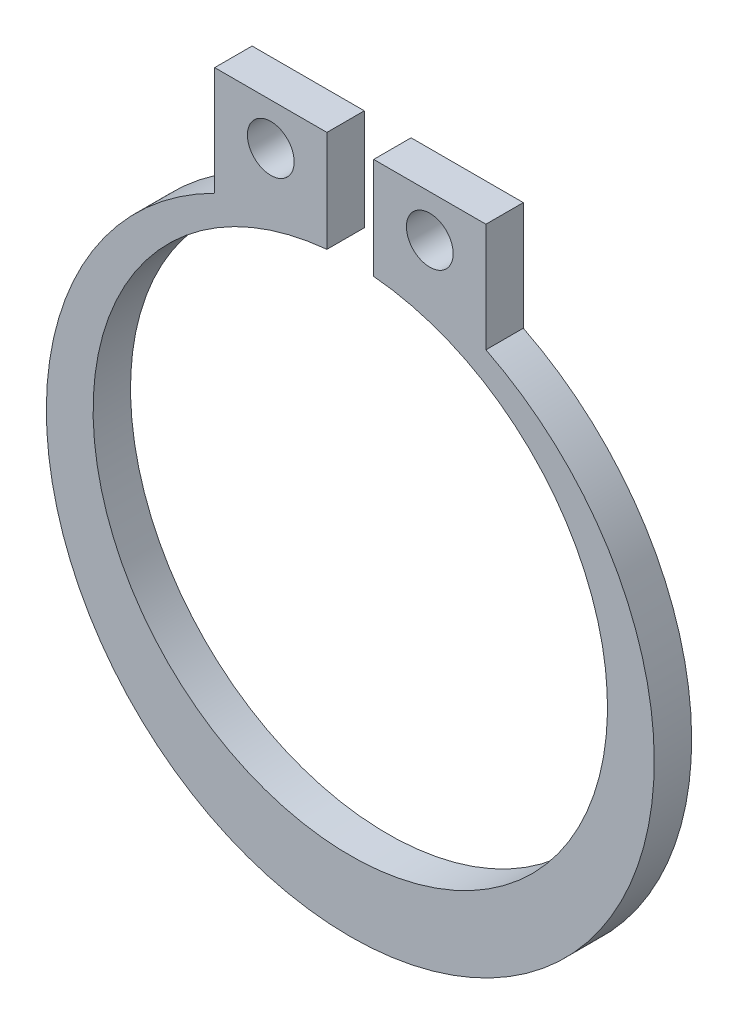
ISO-10303-21;
HEADER;
FILE_DESCRIPTION(('STEP AP214'),'2;1');
FILE_NAME('part.step','',(''),(''),'','','');
FILE_SCHEMA(('AUTOMOTIVE_DESIGN { 1 0 10303 214 1 1 1 1 }'));
ENDSEC;
DATA;
#1=APPLICATION_CONTEXT('core data for automotive mechanical design processes');
#2=APPLICATION_PROTOCOL_DEFINITION('international standard','automotive_design',2000,#1);
#3=PRODUCT_CONTEXT('',#1,'mechanical');
#4=PRODUCT('Part','Part','',(#3));
#5=PRODUCT_RELATED_PRODUCT_CATEGORY('part','',(#4));
#6=PRODUCT_DEFINITION_FORMATION('','',#4);
#7=PRODUCT_DEFINITION_CONTEXT('part definition',#1,'design');
#8=PRODUCT_DEFINITION('design','',#6,#7);
#9=PRODUCT_DEFINITION_SHAPE('','',#8);
#10=(LENGTH_UNIT() NAMED_UNIT(*) SI_UNIT(.MILLI.,.METRE.));
#11=(NAMED_UNIT(*) PLANE_ANGLE_UNIT() SI_UNIT($,.RADIAN.));
#12=(NAMED_UNIT(*) SI_UNIT($,.STERADIAN.) SOLID_ANGLE_UNIT());
#13=UNCERTAINTY_MEASURE_WITH_UNIT(LENGTH_MEASURE(1.E-05),#10,'distance_accuracy_value','');
#14=(GEOMETRIC_REPRESENTATION_CONTEXT(3) GLOBAL_UNCERTAINTY_ASSIGNED_CONTEXT((#13)) GLOBAL_UNIT_ASSIGNED_CONTEXT((#10,
#11,#12)) REPRESENTATION_CONTEXT('',''));
#15=CARTESIAN_POINT('',(0.,0.,0.));
#16=DIRECTION('',(0.,0.,1.));
#17=DIRECTION('',(1.,0.,0.));
#18=AXIS2_PLACEMENT_3D('',#15,#16,#17);
#19=CARTESIAN_POINT('',(-2.40918396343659E-11,0.,0.799999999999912));
#20=DIRECTION('',(0.,0.,1.));
#21=DIRECTION('',(1.,0.,0.));
#22=AXIS2_PLACEMENT_3D('',#19,#20,#21);
#23=PLANE('',#22);
#24=CARTESIAN_POINT('',(-1.70000000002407,6.74767345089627,0.799999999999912));
#25=DIRECTION('',(0.,0.,1.));
#26=DIRECTION('',(1.,0.,0.));
#27=AXIS2_PLACEMENT_3D('',#24,#25,#26);
#28=CIRCLE('',#27,0.5);
#29=CARTESIAN_POINT('',(-1.20000000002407,6.74767345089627,0.799999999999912));
#30=VERTEX_POINT('',#29);
#31=EDGE_CURVE('E432',#30,#30,#28,.T.);
#32=ORIENTED_EDGE('',*,*,#31,.F.);
#33=EDGE_LOOP('',(#32));
#34=FACE_BOUND('',#33,.T.);
#35=CARTESIAN_POINT('',(-2.40918396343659E-11,0.,0.799999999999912));
#36=DIRECTION('',(0.,0.,-1.));
#37=DIRECTION('',(1.,0.,0.));
#38=AXIS2_PLACEMENT_3D('',#35,#36,#37);
#39=CIRCLE('',#38,5.5);
#40=CARTESIAN_POINT('',(0.499999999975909,5.47722557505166,0.799999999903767));
#41=VERTEX_POINT('',#40);
#42=CARTESIAN_POINT('',(-0.500000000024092,5.47722557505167,0.799999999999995));
#43=VERTEX_POINT('',#42);
#44=EDGE_CURVE('E450',#41,#43,#39,.T.);
#45=ORIENTED_EDGE('',*,*,#44,.T.);
#46=DIRECTION('',(0.,1.,0.));
#47=VECTOR('',#46,1.);
#48=CARTESIAN_POINT('',(-0.500000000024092,7.64373744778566,0.799999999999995));
#49=LINE('',#48,#47);
#50=CARTESIAN_POINT('',(-0.500000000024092,7.64373744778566,0.799999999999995));
#51=VERTEX_POINT('',#50);
#52=EDGE_CURVE('E427',#43,#51,#49,.T.);
#53=ORIENTED_EDGE('',*,*,#52,.T.);
#54=DIRECTION('',(-1.,0.,0.));
#55=VECTOR('',#54,1.);
#56=CARTESIAN_POINT('',(-2.90000000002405,7.64373744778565,0.799999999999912));
#57=LINE('',#56,#55);
#58=CARTESIAN_POINT('',(-2.90000000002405,7.64373744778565,0.799999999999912));
#59=VERTEX_POINT('',#58);
#60=EDGE_CURVE('E453',#51,#59,#57,.T.);
#61=ORIENTED_EDGE('',*,*,#60,.T.);
#62=DIRECTION('',(0.,-1.,0.));
#63=VECTOR('',#62,1.);
#64=CARTESIAN_POINT('',(-2.90000000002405,7.64373744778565,0.799999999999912));
#65=LINE('',#64,#63);
#66=CARTESIAN_POINT('',(-2.90000000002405,5.3172158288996,0.799999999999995));
#67=VERTEX_POINT('',#66);
#68=EDGE_CURVE('E455',#59,#67,#65,.T.);
#69=ORIENTED_EDGE('',*,*,#68,.T.);
#70=CARTESIAN_POINT('',(-2.40918396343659E-11,-0.5,0.799999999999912));
#71=DIRECTION('',(0.,0.,1.));
#72=DIRECTION('',(1.,0.,0.));
#73=AXIS2_PLACEMENT_3D('',#70,#71,#72);
#74=CIRCLE('',#73,6.5);
#75=CARTESIAN_POINT('',(2.89999999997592,5.31721582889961,0.799999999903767));
#76=VERTEX_POINT('',#75);
#77=EDGE_CURVE('E457',#67,#76,#74,.T.);
#78=ORIENTED_EDGE('',*,*,#77,.T.);
#79=DIRECTION('',(0.,1.,0.));
#80=VECTOR('',#79,1.);
#81=CARTESIAN_POINT('',(2.89999999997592,7.64373744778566,0.799999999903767));
#82=LINE('',#81,#80);
#83=CARTESIAN_POINT('',(2.89999999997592,7.64373744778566,0.799999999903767));
#84=VERTEX_POINT('',#83);
#85=EDGE_CURVE('E459',#76,#84,#82,.T.);
#86=ORIENTED_EDGE('',*,*,#85,.T.);
#87=DIRECTION('',(-1.,0.,0.));
#88=VECTOR('',#87,1.);
#89=CARTESIAN_POINT('',(0.499999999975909,7.64373744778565,0.799999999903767));
#90=LINE('',#89,#88);
#91=CARTESIAN_POINT('',(0.499999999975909,7.64373744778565,0.799999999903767));
#92=VERTEX_POINT('',#91);
#93=EDGE_CURVE('E368',#84,#92,#90,.T.);
#94=ORIENTED_EDGE('',*,*,#93,.T.);
#95=DIRECTION('',(0.,-1.,0.));
#96=VECTOR('',#95,1.);
#97=CARTESIAN_POINT('',(0.499999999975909,7.64373744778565,0.799999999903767));
#98=LINE('',#97,#96);
#99=EDGE_CURVE('E363',#92,#41,#98,.T.);
#100=ORIENTED_EDGE('',*,*,#99,.T.);
#101=EDGE_LOOP('',(#45,#53,#61,#69,#78,#86,#94,#100));
#102=FACE_BOUND('',#101,.T.);
#103=CARTESIAN_POINT('',(1.69999999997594,6.74767345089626,0.799999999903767));
#104=DIRECTION('',(0.,0.,1.));
#105=DIRECTION('',(-1.,0.,0.));
#106=AXIS2_PLACEMENT_3D('',#103,#104,#105);
#107=CIRCLE('',#106,0.5);
#108=CARTESIAN_POINT('',(1.19999999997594,6.74767345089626,0.799999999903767));
#109=VERTEX_POINT('',#108);
#110=EDGE_CURVE('E530',#109,#109,#107,.T.);
#111=ORIENTED_EDGE('',*,*,#110,.F.);
#112=EDGE_LOOP('',(#111));
#113=FACE_BOUND('',#112,.T.);
#114=ADVANCED_FACE('F348',(#34,#102,#113),#23,.T.);
#115=CARTESIAN_POINT('',(0.,0.,0.));
#116=DIRECTION('',(0.,0.,1.));
#117=DIRECTION('',(1.,0.,0.));
#118=AXIS2_PLACEMENT_3D('',#115,#116,#117);
#119=PLANE('',#118);
#120=CARTESIAN_POINT('',(-1.69999999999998,6.74767345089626,0.));
#121=DIRECTION('',(0.,0.,1.));
#122=DIRECTION('',(1.,0.,0.));
#123=AXIS2_PLACEMENT_3D('',#120,#121,#122);
#124=CIRCLE('',#123,0.5);
#125=CARTESIAN_POINT('',(-1.19999999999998,6.74767345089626,0.));
#126=VERTEX_POINT('',#125);
#127=EDGE_CURVE('E435',#126,#126,#124,.T.);
#128=ORIENTED_EDGE('',*,*,#127,.T.);
#129=EDGE_LOOP('',(#128));
#130=FACE_BOUND('',#129,.T.);
#131=CARTESIAN_POINT('',(0.,0.,0.));
#132=DIRECTION('',(0.,0.,-1.));
#133=DIRECTION('',(1.,0.,0.));
#134=AXIS2_PLACEMENT_3D('',#131,#132,#133);
#135=CIRCLE('',#134,5.5);
#136=CARTESIAN_POINT('',(0.5,5.47722557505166,-9.63673585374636E-11));
#137=VERTEX_POINT('',#136);
#138=CARTESIAN_POINT('',(-0.5,5.47722557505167,0.));
#139=VERTEX_POINT('',#138);
#140=EDGE_CURVE('E418',#137,#139,#135,.T.);
#141=ORIENTED_EDGE('',*,*,#140,.F.);
#142=DIRECTION('',(0.,-1.,0.));
#143=VECTOR('',#142,1.);
#144=CARTESIAN_POINT('',(0.5,7.64373744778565,-9.63673585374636E-11));
#145=LINE('',#144,#143);
#146=CARTESIAN_POINT('',(0.5,7.64373744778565,-9.63673585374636E-11));
#147=VERTEX_POINT('',#146);
#148=EDGE_CURVE('E448',#147,#137,#145,.T.);
#149=ORIENTED_EDGE('',*,*,#148,.F.);
#150=DIRECTION('',(-1.,0.,0.));
#151=VECTOR('',#150,1.);
#152=CARTESIAN_POINT('',(0.5,7.64373744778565,-9.63673585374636E-11));
#153=LINE('',#152,#151);
#154=CARTESIAN_POINT('',(2.90000000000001,7.64373744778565,-9.63673585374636E-11));
#155=VERTEX_POINT('',#154);
#156=EDGE_CURVE('E446',#155,#147,#153,.T.);
#157=ORIENTED_EDGE('',*,*,#156,.F.);
#158=DIRECTION('',(0.,1.,0.));
#159=VECTOR('',#158,1.);
#160=CARTESIAN_POINT('',(2.90000000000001,7.64373744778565,-9.63673585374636E-11));
#161=LINE('',#160,#159);
#162=CARTESIAN_POINT('',(2.90000000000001,5.3172158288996,-9.63673585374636E-11));
#163=VERTEX_POINT('',#162);
#164=EDGE_CURVE('E444',#163,#155,#161,.T.);
#165=ORIENTED_EDGE('',*,*,#164,.F.);
#166=CARTESIAN_POINT('',(0.,-0.5,0.));
#167=DIRECTION('',(0.,0.,1.));
#168=DIRECTION('',(1.,0.,0.));
#169=AXIS2_PLACEMENT_3D('',#166,#167,#168);
#170=CIRCLE('',#169,6.5);
#171=CARTESIAN_POINT('',(-2.90000000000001,5.3172158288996,0.));
#172=VERTEX_POINT('',#171);
#173=EDGE_CURVE('E442',#172,#163,#170,.T.);
#174=ORIENTED_EDGE('',*,*,#173,.F.);
#175=DIRECTION('',(0.,-1.,0.));
#176=VECTOR('',#175,1.);
#177=CARTESIAN_POINT('',(-2.90000000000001,7.64373744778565,0.));
#178=LINE('',#177,#176);
#179=CARTESIAN_POINT('',(-2.90000000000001,7.64373744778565,0.));
#180=VERTEX_POINT('',#179);
#181=EDGE_CURVE('E440',#180,#172,#178,.T.);
#182=ORIENTED_EDGE('',*,*,#181,.F.);
#183=DIRECTION('',(-1.,0.,0.));
#184=VECTOR('',#183,1.);
#185=CARTESIAN_POINT('',(-2.90000000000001,7.64373744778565,0.));
#186=LINE('',#185,#184);
#187=CARTESIAN_POINT('',(-0.5,7.64373744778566,0.));
#188=VERTEX_POINT('',#187);
#189=EDGE_CURVE('E420',#188,#180,#186,.T.);
#190=ORIENTED_EDGE('',*,*,#189,.F.);
#191=DIRECTION('',(0.,1.,0.));
#192=VECTOR('',#191,1.);
#193=CARTESIAN_POINT('',(-0.5,7.64373744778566,0.));
#194=LINE('',#193,#192);
#195=EDGE_CURVE('E413',#139,#188,#194,.T.);
#196=ORIENTED_EDGE('',*,*,#195,.F.);
#197=EDGE_LOOP('',(#141,#149,#157,#165,#174,#182,#190,#196));
#198=FACE_BOUND('',#197,.T.);
#199=CARTESIAN_POINT('',(1.69999999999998,6.74767345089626,-9.63673585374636E-11));
#200=DIRECTION('',(0.,0.,1.));
#201=DIRECTION('',(-1.,0.,0.));
#202=AXIS2_PLACEMENT_3D('',#199,#200,#201);
#203=CIRCLE('',#202,0.5);
#204=CARTESIAN_POINT('',(1.19999999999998,6.74767345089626,-9.63673585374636E-11));
#205=VERTEX_POINT('',#204);
#206=EDGE_CURVE('E533',#205,#205,#203,.T.);
#207=ORIENTED_EDGE('',*,*,#206,.T.);
#208=EDGE_LOOP('',(#207));
#209=FACE_BOUND('',#208,.T.);
#210=ADVANCED_FACE('F414',(#130,#198,#209),#119,.F.);
#211=CARTESIAN_POINT('',(-2.40918396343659E-11,0.,0.799999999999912));
#212=DIRECTION('',(0.,0.,-1.));
#213=DIRECTION('',(-1.,0.,0.));
#214=AXIS2_PLACEMENT_3D('',#211,#212,#213);
#215=CYLINDRICAL_SURFACE('',#214,5.5);
#216=ORIENTED_EDGE('',*,*,#140,.T.);
#217=DIRECTION('',(0.,0.,-1.));
#218=VECTOR('',#217,1.);
#219=CARTESIAN_POINT('',(-0.500000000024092,5.47722557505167,0.799999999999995));
#220=LINE('',#219,#218);
#221=EDGE_CURVE('E11',#43,#139,#220,.T.);
#222=ORIENTED_EDGE('',*,*,#221,.F.);
#223=ORIENTED_EDGE('',*,*,#44,.F.);
#224=DIRECTION('',(0.,0.,-1.));
#225=VECTOR('',#224,1.);
#226=CARTESIAN_POINT('',(0.499999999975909,5.47722557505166,0.799999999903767));
#227=LINE('',#226,#225);
#228=EDGE_CURVE('E431',#41,#137,#227,.T.);
#229=ORIENTED_EDGE('',*,*,#228,.T.);
#230=EDGE_LOOP('',(#216,#222,#223,#229));
#231=FACE_BOUND('',#230,.T.);
#232=ADVANCED_FACE('F350',(#231),#215,.F.);
#233=CARTESIAN_POINT('',(-0.500000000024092,7.64373744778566,0.799999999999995));
#234=DIRECTION('',(-1.,0.,0.));
#235=DIRECTION('',(0.,-1.,0.));
#236=AXIS2_PLACEMENT_3D('',#233,#234,#235);
#237=PLANE('',#236);
#238=ORIENTED_EDGE('',*,*,#195,.T.);
#239=DIRECTION('',(0.,0.,-1.));
#240=VECTOR('',#239,1.);
#241=CARTESIAN_POINT('',(-0.500000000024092,7.64373744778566,0.799999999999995));
#242=LINE('',#241,#240);
#243=EDGE_CURVE('E356',#51,#188,#242,.T.);
#244=ORIENTED_EDGE('',*,*,#243,.F.);
#245=ORIENTED_EDGE('',*,*,#52,.F.);
#246=ORIENTED_EDGE('',*,*,#221,.T.);
#247=EDGE_LOOP('',(#238,#244,#245,#246));
#248=FACE_BOUND('',#247,.T.);
#249=ADVANCED_FACE('F426',(#248),#237,.F.);
#250=CARTESIAN_POINT('',(-2.90000000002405,7.64373744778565,0.799999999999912));
#251=DIRECTION('',(0.,-1.,0.));
#252=DIRECTION('',(0.,0.,-1.));
#253=AXIS2_PLACEMENT_3D('',#250,#251,#252);
#254=PLANE('',#253);
#255=ORIENTED_EDGE('',*,*,#189,.T.);
#256=DIRECTION('',(0.,0.,-1.));
#257=VECTOR('',#256,1.);
#258=CARTESIAN_POINT('',(-2.90000000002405,7.64373744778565,0.799999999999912));
#259=LINE('',#258,#257);
#260=EDGE_CURVE('E476',#59,#180,#259,.T.);
#261=ORIENTED_EDGE('',*,*,#260,.F.);
#262=ORIENTED_EDGE('',*,*,#60,.F.);
#263=ORIENTED_EDGE('',*,*,#243,.T.);
#264=EDGE_LOOP('',(#255,#261,#262,#263));
#265=FACE_BOUND('',#264,.T.);
#266=ADVANCED_FACE('F480',(#265),#254,.F.);
#267=CARTESIAN_POINT('',(-2.90000000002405,7.64373744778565,0.799999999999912));
#268=DIRECTION('',(1.,0.,0.));
#269=DIRECTION('',(0.,1.,0.));
#270=AXIS2_PLACEMENT_3D('',#267,#268,#269);
#271=PLANE('',#270);
#272=ORIENTED_EDGE('',*,*,#181,.T.);
#273=DIRECTION('',(0.,0.,-1.));
#274=VECTOR('',#273,1.);
#275=CARTESIAN_POINT('',(-2.90000000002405,5.3172158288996,0.799999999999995));
#276=LINE('',#275,#274);
#277=EDGE_CURVE('E473',#67,#172,#276,.T.);
#278=ORIENTED_EDGE('',*,*,#277,.F.);
#279=ORIENTED_EDGE('',*,*,#68,.F.);
#280=ORIENTED_EDGE('',*,*,#260,.T.);
#281=EDGE_LOOP('',(#272,#278,#279,#280));
#282=FACE_BOUND('',#281,.T.);
#283=ADVANCED_FACE('F488',(#282),#271,.F.);
#284=CARTESIAN_POINT('',(-2.40918396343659E-11,-0.5,0.799999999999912));
#285=DIRECTION('',(0.,0.,-1.));
#286=DIRECTION('',(-1.,0.,0.));
#287=AXIS2_PLACEMENT_3D('',#284,#285,#286);
#288=CYLINDRICAL_SURFACE('',#287,6.5);
#289=ORIENTED_EDGE('',*,*,#173,.T.);
#290=DIRECTION('',(0.,0.,-1.));
#291=VECTOR('',#290,1.);
#292=CARTESIAN_POINT('',(2.89999999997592,5.31721582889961,0.799999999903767));
#293=LINE('',#292,#291);
#294=EDGE_CURVE('E470',#76,#163,#293,.T.);
#295=ORIENTED_EDGE('',*,*,#294,.F.);
#296=ORIENTED_EDGE('',*,*,#77,.F.);
#297=ORIENTED_EDGE('',*,*,#277,.T.);
#298=EDGE_LOOP('',(#289,#295,#296,#297));
#299=FACE_BOUND('',#298,.T.);
#300=ADVANCED_FACE('F491',(#299),#288,.T.);
#301=CARTESIAN_POINT('',(2.89999999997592,7.64373744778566,0.799999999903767));
#302=DIRECTION('',(-1.,0.,0.));
#303=DIRECTION('',(0.,0.,1.));
#304=AXIS2_PLACEMENT_3D('',#301,#302,#303);
#305=PLANE('',#304);
#306=ORIENTED_EDGE('',*,*,#164,.T.);
#307=DIRECTION('',(0.,0.,-1.));
#308=VECTOR('',#307,1.);
#309=CARTESIAN_POINT('',(2.89999999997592,7.64373744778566,0.799999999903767));
#310=LINE('',#309,#308);
#311=EDGE_CURVE('E467',#84,#155,#310,.T.);
#312=ORIENTED_EDGE('',*,*,#311,.F.);
#313=ORIENTED_EDGE('',*,*,#85,.F.);
#314=ORIENTED_EDGE('',*,*,#294,.T.);
#315=EDGE_LOOP('',(#306,#312,#313,#314));
#316=FACE_BOUND('',#315,.T.);
#317=ADVANCED_FACE('F496',(#316),#305,.F.);
#318=CARTESIAN_POINT('',(0.499999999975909,7.64373744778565,0.799999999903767));
#319=DIRECTION('',(0.,-1.,0.));
#320=DIRECTION('',(1.,0.,0.));
#321=AXIS2_PLACEMENT_3D('',#318,#319,#320);
#322=PLANE('',#321);
#323=ORIENTED_EDGE('',*,*,#156,.T.);
#324=DIRECTION('',(0.,0.,-1.));
#325=VECTOR('',#324,1.);
#326=CARTESIAN_POINT('',(0.499999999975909,7.64373744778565,0.799999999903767));
#327=LINE('',#326,#325);
#328=EDGE_CURVE('E464',#92,#147,#327,.T.);
#329=ORIENTED_EDGE('',*,*,#328,.F.);
#330=ORIENTED_EDGE('',*,*,#93,.F.);
#331=ORIENTED_EDGE('',*,*,#311,.T.);
#332=EDGE_LOOP('',(#323,#329,#330,#331));
#333=FACE_BOUND('',#332,.T.);
#334=ADVANCED_FACE('F499',(#333),#322,.F.);
#335=CARTESIAN_POINT('',(0.499999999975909,7.64373744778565,0.799999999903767));
#336=DIRECTION('',(1.,0.,0.));
#337=DIRECTION('',(0.,1.,0.));
#338=AXIS2_PLACEMENT_3D('',#335,#336,#337);
#339=PLANE('',#338);
#340=ORIENTED_EDGE('',*,*,#148,.T.);
#341=ORIENTED_EDGE('',*,*,#228,.F.);
#342=ORIENTED_EDGE('',*,*,#99,.F.);
#343=ORIENTED_EDGE('',*,*,#328,.T.);
#344=EDGE_LOOP('',(#340,#341,#342,#343));
#345=FACE_BOUND('',#344,.T.);
#346=ADVANCED_FACE('F501',(#345),#339,.F.);
#347=CARTESIAN_POINT('',(-1.70000000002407,6.74767345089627,0.799999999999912));
#348=DIRECTION('',(0.,0.,-1.));
#349=DIRECTION('',(-1.,0.,0.));
#350=AXIS2_PLACEMENT_3D('',#347,#348,#349);
#351=CYLINDRICAL_SURFACE('',#350,0.5);
#352=ORIENTED_EDGE('',*,*,#31,.T.);
#353=EDGE_LOOP('',(#352));
#354=FACE_BOUND('',#353,.T.);
#355=ORIENTED_EDGE('',*,*,#127,.F.);
#356=EDGE_LOOP('',(#355));
#357=FACE_BOUND('',#356,.T.);
#358=ADVANCED_FACE('F503',(#354,#357),#351,.F.);
#359=CARTESIAN_POINT('',(1.69999999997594,6.74767345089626,0.799999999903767));
#360=DIRECTION('',(0.,0.,-1.));
#361=DIRECTION('',(-1.,0.,0.));
#362=AXIS2_PLACEMENT_3D('',#359,#360,#361);
#363=CYLINDRICAL_SURFACE('',#362,0.5);
#364=ORIENTED_EDGE('',*,*,#110,.T.);
#365=EDGE_LOOP('',(#364));
#366=FACE_BOUND('',#365,.T.);
#367=ORIENTED_EDGE('',*,*,#206,.F.);
#368=EDGE_LOOP('',(#367));
#369=FACE_BOUND('',#368,.T.);
#370=ADVANCED_FACE('F509',(#366,#369),#363,.F.);
#371=CLOSED_SHELL('',(#114,#210,#232,#249,#266,#283,#300,#317,#334,#346,#358,#370));
#372=MANIFOLD_SOLID_BREP('B2',#371);
#373=ADVANCED_BREP_SHAPE_REPRESENTATION('',(#18,#372),#14);
#374=SHAPE_DEFINITION_REPRESENTATION(#9,#373);
ENDSEC;
END-ISO-10303-21;
